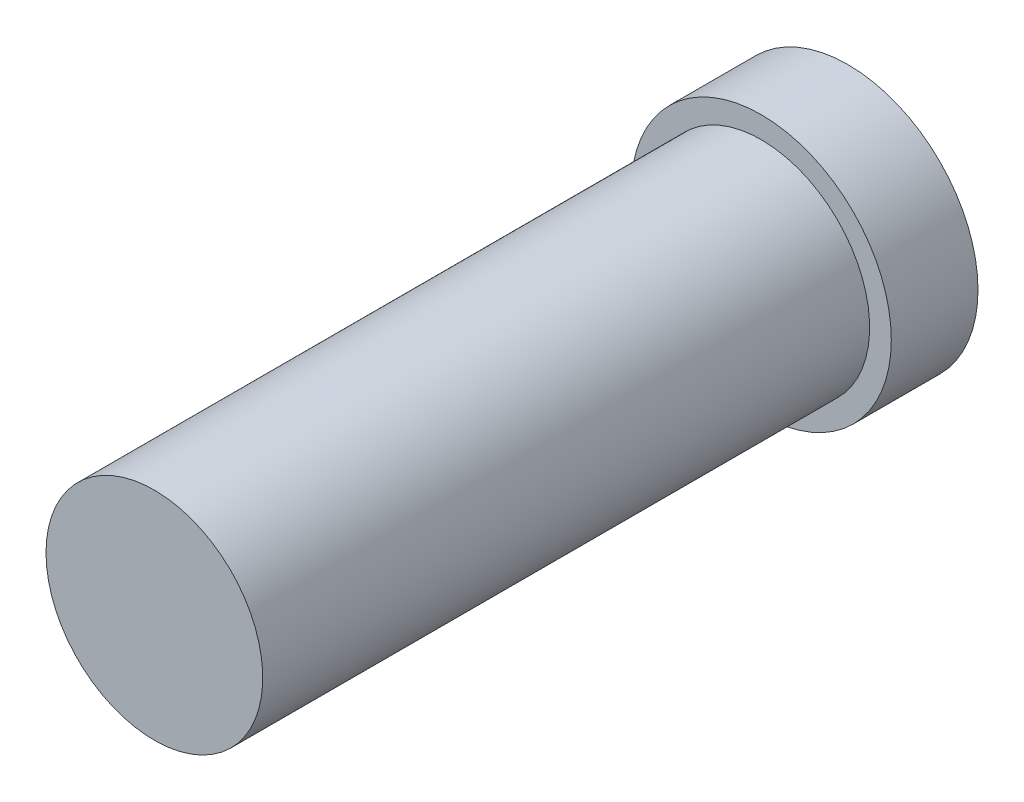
ISO-10303-21;
HEADER;
FILE_DESCRIPTION(('STEP AP214'),'2;1');
FILE_NAME('part.step','',(''),(''),'','','');
FILE_SCHEMA(('AUTOMOTIVE_DESIGN { 1 0 10303 214 1 1 1 1 }'));
ENDSEC;
DATA;
#1=APPLICATION_CONTEXT('core data for automotive mechanical design processes');
#2=APPLICATION_PROTOCOL_DEFINITION('international standard','automotive_design',2000,#1);
#3=PRODUCT_CONTEXT('',#1,'mechanical');
#4=PRODUCT('Part','Part','',(#3));
#5=PRODUCT_RELATED_PRODUCT_CATEGORY('part','',(#4));
#6=PRODUCT_DEFINITION_FORMATION('','',#4);
#7=PRODUCT_DEFINITION_CONTEXT('part definition',#1,'design');
#8=PRODUCT_DEFINITION('design','',#6,#7);
#9=PRODUCT_DEFINITION_SHAPE('','',#8);
#10=(LENGTH_UNIT() NAMED_UNIT(*) SI_UNIT(.MILLI.,.METRE.));
#11=(NAMED_UNIT(*) PLANE_ANGLE_UNIT() SI_UNIT($,.RADIAN.));
#12=(NAMED_UNIT(*) SI_UNIT($,.STERADIAN.) SOLID_ANGLE_UNIT());
#13=UNCERTAINTY_MEASURE_WITH_UNIT(LENGTH_MEASURE(1.E-05),#10,'distance_accuracy_value','');
#14=(GEOMETRIC_REPRESENTATION_CONTEXT(3) GLOBAL_UNCERTAINTY_ASSIGNED_CONTEXT((#13)) GLOBAL_UNIT_ASSIGNED_CONTEXT((#10,
#11,#12)) REPRESENTATION_CONTEXT('',''));
#15=CARTESIAN_POINT('',(0.,0.,0.));
#16=DIRECTION('',(0.,0.,1.));
#17=DIRECTION('',(1.,0.,0.));
#18=AXIS2_PLACEMENT_3D('',#15,#16,#17);
#19=CARTESIAN_POINT('',(0.,0.,-16.5467541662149));
#20=DIRECTION('',(0.,0.,-1.));
#21=DIRECTION('',(-1.,0.,0.));
#22=AXIS2_PLACEMENT_3D('',#19,#20,#21);
#23=CYLINDRICAL_SURFACE('',#22,9.525);
#24=CARTESIAN_POINT('',(0.,0.,-6.35));
#25=DIRECTION('',(0.,0.,-1.));
#26=DIRECTION('',(-1.,0.,0.));
#27=AXIS2_PLACEMENT_3D('',#24,#25,#26);
#28=CIRCLE('',#27,9.525);
#29=CARTESIAN_POINT('',(-9.525,0.,-6.35));
#30=VERTEX_POINT('',#29);
#31=EDGE_CURVE('E60',#30,#30,#28,.T.);
#32=ORIENTED_EDGE('',*,*,#31,.F.);
#33=EDGE_LOOP('',(#32));
#34=FACE_BOUND('',#33,.T.);
#35=CARTESIAN_POINT('',(0.,0.,0.));
#36=DIRECTION('',(0.,0.,-1.));
#37=DIRECTION('',(-1.,0.,0.));
#38=AXIS2_PLACEMENT_3D('',#35,#36,#37);
#39=CIRCLE('',#38,9.525);
#40=CARTESIAN_POINT('',(-9.525,0.,0.));
#41=VERTEX_POINT('',#40);
#42=EDGE_CURVE('E10',#41,#41,#39,.T.);
#43=ORIENTED_EDGE('',*,*,#42,.T.);
#44=EDGE_LOOP('',(#43));
#45=FACE_BOUND('',#44,.T.);
#46=ADVANCED_FACE('F41',(#34,#45),#23,.T.);
#47=CARTESIAN_POINT('',(-7.93750000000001,0.,0.));
#48=DIRECTION('',(0.,0.,-1.));
#49=DIRECTION('',(-1.,0.,0.));
#50=AXIS2_PLACEMENT_3D('',#47,#48,#49);
#51=PLANE('',#50);
#52=ORIENTED_EDGE('',*,*,#42,.F.);
#53=EDGE_LOOP('',(#52));
#54=FACE_BOUND('',#53,.T.);
#55=CARTESIAN_POINT('',(0.,0.,0.));
#56=DIRECTION('',(0.,0.,-1.));
#57=DIRECTION('',(-1.,0.,0.));
#58=AXIS2_PLACEMENT_3D('',#55,#56,#57);
#59=CIRCLE('',#58,7.9375);
#60=CARTESIAN_POINT('',(-7.9375,0.,0.));
#61=VERTEX_POINT('',#60);
#62=EDGE_CURVE('E48',#61,#61,#59,.T.);
#63=ORIENTED_EDGE('',*,*,#62,.T.);
#64=EDGE_LOOP('',(#63));
#65=FACE_BOUND('',#64,.T.);
#66=ADVANCED_FACE('F71',(#54,#65),#51,.F.);
#67=CARTESIAN_POINT('',(0.,0.,-16.5467541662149));
#68=DIRECTION('',(0.,0.,-1.));
#69=DIRECTION('',(-1.,0.,0.));
#70=AXIS2_PLACEMENT_3D('',#67,#68,#69);
#71=CYLINDRICAL_SURFACE('',#70,7.9375);
#72=ORIENTED_EDGE('',*,*,#62,.F.);
#73=EDGE_LOOP('',(#72));
#74=FACE_BOUND('',#73,.T.);
#75=CARTESIAN_POINT('',(0.,0.,44.45));
#76=DIRECTION('',(0.,0.,-1.));
#77=DIRECTION('',(-1.,0.,0.));
#78=AXIS2_PLACEMENT_3D('',#75,#76,#77);
#79=CIRCLE('',#78,7.93749999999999);
#80=CARTESIAN_POINT('',(-7.93749999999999,0.,44.45));
#81=VERTEX_POINT('',#80);
#82=EDGE_CURVE('E54',#81,#81,#79,.T.);
#83=ORIENTED_EDGE('',*,*,#82,.T.);
#84=EDGE_LOOP('',(#83));
#85=FACE_BOUND('',#84,.T.);
#86=ADVANCED_FACE('F75',(#74,#85),#71,.T.);
#87=CARTESIAN_POINT('',(0.,0.,44.45));
#88=DIRECTION('',(0.,0.,-1.));
#89=DIRECTION('',(-1.,0.,0.));
#90=AXIS2_PLACEMENT_3D('',#87,#88,#89);
#91=PLANE('',#90);
#92=ORIENTED_EDGE('',*,*,#82,.F.);
#93=EDGE_LOOP('',(#92));
#94=FACE_BOUND('',#93,.T.);
#95=ADVANCED_FACE('F80',(#94),#91,.F.);
#96=CARTESIAN_POINT('',(0.,0.,-6.35));
#97=DIRECTION('',(0.,0.,1.));
#98=DIRECTION('',(1.,0.,0.));
#99=AXIS2_PLACEMENT_3D('',#96,#97,#98);
#100=PLANE('',#99);
#101=ORIENTED_EDGE('',*,*,#31,.T.);
#102=EDGE_LOOP('',(#101));
#103=FACE_BOUND('',#102,.T.);
#104=ADVANCED_FACE('F68',(#103),#100,.F.);
#105=CLOSED_SHELL('',(#46,#66,#86,#95,#104));
#106=MANIFOLD_SOLID_BREP('B2',#105);
#107=ADVANCED_BREP_SHAPE_REPRESENTATION('',(#18,#106),#14);
#108=SHAPE_DEFINITION_REPRESENTATION(#9,#107);
ENDSEC;
END-ISO-10303-21;
